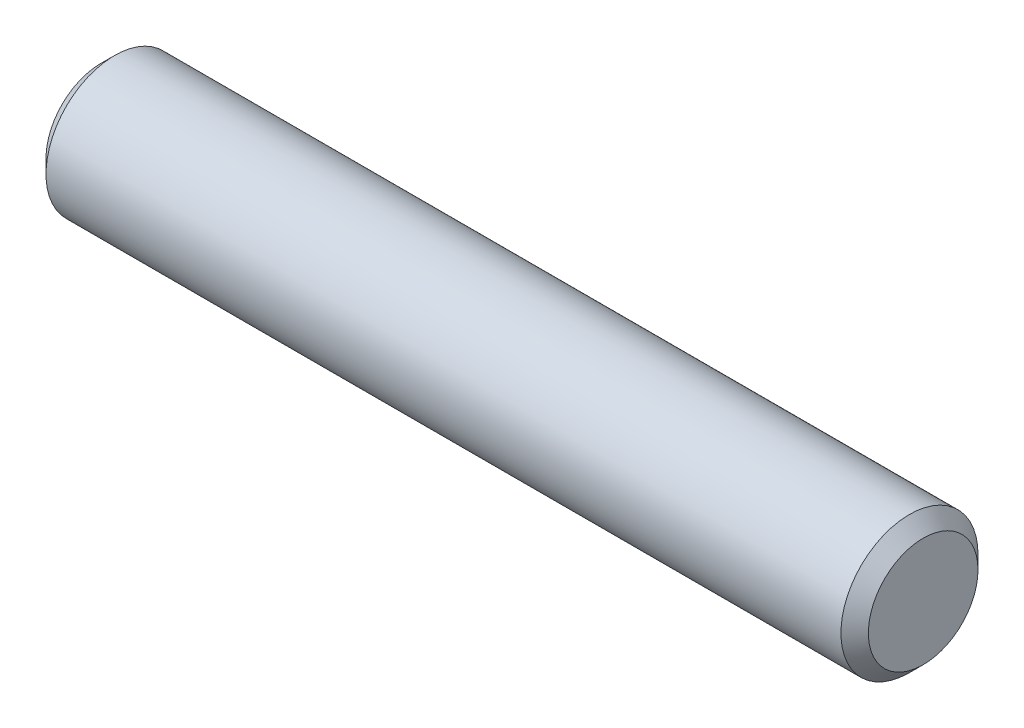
from build123d import *

# Parameters (mm, degrees)
EXTRUDE1_DEPTH      = 4.7625
EXTRUDE1_DEPTH_BACK = 4.7625
SKETCH2_R           = 0.79375
CHAMFER1_SIZE       = 0.15875


with BuildPart() as part:
    # Sketch2 → Extrude1 (new, two sides: drawn at the far end of the back side and taken through both)
    with BuildSketch(Plane(origin=(0, 0, 0), x_dir=(0, 0, -1), z_dir=(1, 0, 0)).offset(-EXTRUDE1_DEPTH_BACK)):
        Circle(SKETCH2_R)
    extrude(amount=EXTRUDE1_DEPTH + EXTRUDE1_DEPTH_BACK)

    # Chamfer1
    chamfer1_edges = [part.edges().sort_by_distance(p)[0] for p in [
        (-4.7625, 0, 0.79375),
        (4.7625, 0, 0.79375),
    ]]
    chamfer(chamfer1_edges, length=CHAMFER1_SIZE)


solid = part.part
